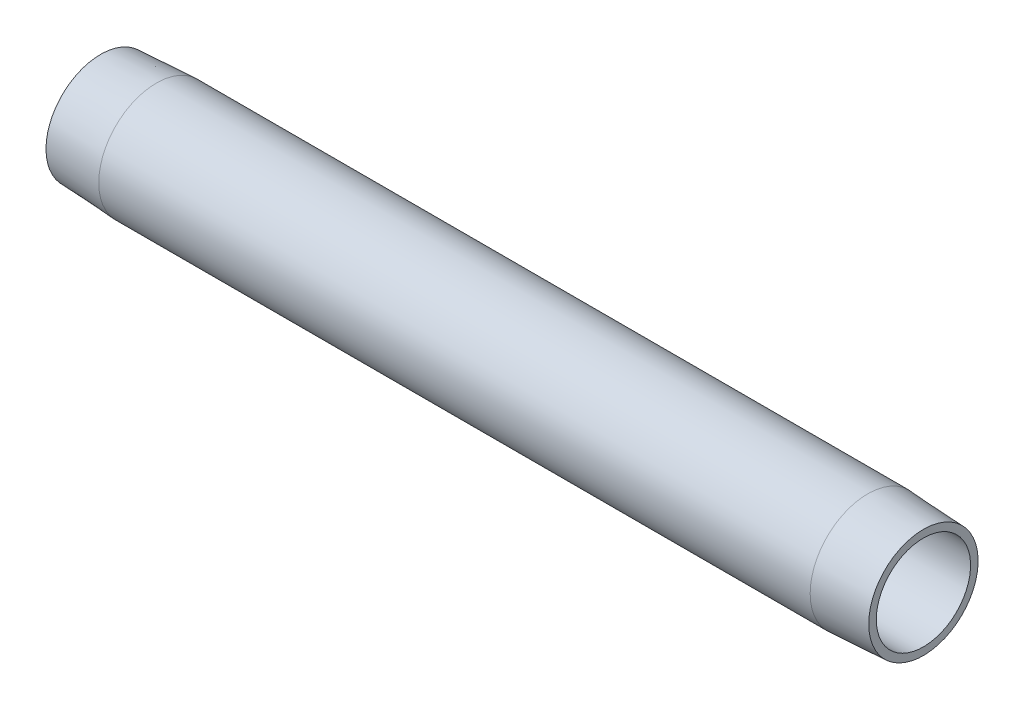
ISO-10303-21;
HEADER;
FILE_DESCRIPTION(('STEP AP214'),'2;1');
FILE_NAME('part.step','',(''),(''),'','','');
FILE_SCHEMA(('AUTOMOTIVE_DESIGN { 1 0 10303 214 1 1 1 1 }'));
ENDSEC;
DATA;
#1=APPLICATION_CONTEXT('core data for automotive mechanical design processes');
#2=APPLICATION_PROTOCOL_DEFINITION('international standard','automotive_design',2000,#1);
#3=PRODUCT_CONTEXT('',#1,'mechanical');
#4=PRODUCT('Part','Part','',(#3));
#5=PRODUCT_RELATED_PRODUCT_CATEGORY('part','',(#4));
#6=PRODUCT_DEFINITION_FORMATION('','',#4);
#7=PRODUCT_DEFINITION_CONTEXT('part definition',#1,'design');
#8=PRODUCT_DEFINITION('design','',#6,#7);
#9=PRODUCT_DEFINITION_SHAPE('','',#8);
#10=(LENGTH_UNIT() NAMED_UNIT(*) SI_UNIT(.MILLI.,.METRE.));
#11=(NAMED_UNIT(*) PLANE_ANGLE_UNIT() SI_UNIT($,.RADIAN.));
#12=(NAMED_UNIT(*) SI_UNIT($,.STERADIAN.) SOLID_ANGLE_UNIT());
#13=UNCERTAINTY_MEASURE_WITH_UNIT(LENGTH_MEASURE(1.E-05),#10,'distance_accuracy_value','');
#14=(GEOMETRIC_REPRESENTATION_CONTEXT(3) GLOBAL_UNCERTAINTY_ASSIGNED_CONTEXT((#13)) GLOBAL_UNIT_ASSIGNED_CONTEXT((#10,
#11,#12)) REPRESENTATION_CONTEXT('',''));
#15=CARTESIAN_POINT('',(0.,0.,0.));
#16=DIRECTION('',(0.,0.,1.));
#17=DIRECTION('',(1.,0.,0.));
#18=AXIS2_PLACEMENT_3D('',#15,#16,#17);
#19=CARTESIAN_POINT('',(152.4,8.73125,0.));
#20=DIRECTION('',(-1.,0.,0.));
#21=DIRECTION('',(0.,0.,1.));
#22=AXIS2_PLACEMENT_3D('',#19,#20,#21);
#23=PLANE('',#22);
#24=CARTESIAN_POINT('',(152.4,0.,0.));
#25=DIRECTION('',(-1.,0.,0.));
#26=DIRECTION('',(0.,0.,1.));
#27=AXIS2_PLACEMENT_3D('',#24,#25,#26);
#28=CIRCLE('',#27,10.1275500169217);
#29=CARTESIAN_POINT('',(152.4,0.,10.1275500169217));
#30=VERTEX_POINT('',#29);
#31=EDGE_CURVE('E10',#30,#30,#28,.T.);
#32=ORIENTED_EDGE('',*,*,#31,.F.);
#33=EDGE_LOOP('',(#32));
#34=FACE_BOUND('',#33,.T.);
#35=CARTESIAN_POINT('',(152.4,0.,0.));
#36=DIRECTION('',(-1.,0.,0.));
#37=DIRECTION('',(0.,0.,1.));
#38=AXIS2_PLACEMENT_3D('',#35,#36,#37);
#39=CIRCLE('',#38,8.73125);
#40=CARTESIAN_POINT('',(152.4,0.,8.73125));
#41=VERTEX_POINT('',#40);
#42=EDGE_CURVE('E52',#41,#41,#39,.T.);
#43=ORIENTED_EDGE('',*,*,#42,.T.);
#44=EDGE_LOOP('',(#43));
#45=FACE_BOUND('',#44,.T.);
#46=ADVANCED_FACE('F30',(#34,#45),#23,.F.);
#47=CARTESIAN_POINT('',(152.4,0.,0.));
#48=DIRECTION('',(-1.,0.,0.));
#49=DIRECTION('',(0.,0.,1.));
#50=AXIS2_PLACEMENT_3D('',#47,#48,#49);
#51=CONICAL_SURFACE('',#50,10.1275500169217,0.0523598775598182);
#52=CARTESIAN_POINT('',(142.0876,0.,0.));
#53=DIRECTION('',(-1.,0.,0.));
#54=DIRECTION('',(0.,0.,1.));
#55=AXIS2_PLACEMENT_3D('',#52,#53,#54);
#56=CIRCLE('',#55,10.668);
#57=CARTESIAN_POINT('',(142.0876,0.,10.668));
#58=VERTEX_POINT('',#57);
#59=EDGE_CURVE('E36',#58,#58,#56,.T.);
#60=ORIENTED_EDGE('',*,*,#59,.F.);
#61=EDGE_LOOP('',(#60));
#62=FACE_BOUND('',#61,.T.);
#63=ORIENTED_EDGE('',*,*,#31,.T.);
#64=EDGE_LOOP('',(#63));
#65=FACE_BOUND('',#64,.T.);
#66=ADVANCED_FACE('F77',(#62,#65),#51,.T.);
#67=CARTESIAN_POINT('',(0.,0.,0.));
#68=DIRECTION('',(-1.,0.,0.));
#69=DIRECTION('',(0.,0.,1.));
#70=AXIS2_PLACEMENT_3D('',#67,#68,#69);
#71=CYLINDRICAL_SURFACE('',#70,10.668);
#72=CARTESIAN_POINT('',(10.3124,0.,0.));
#73=DIRECTION('',(-1.,0.,0.));
#74=DIRECTION('',(0.,0.,1.));
#75=AXIS2_PLACEMENT_3D('',#72,#73,#74);
#76=CIRCLE('',#75,10.668);
#77=CARTESIAN_POINT('',(10.3124,0.,10.668));
#78=VERTEX_POINT('',#77);
#79=EDGE_CURVE('E40',#78,#78,#76,.T.);
#80=ORIENTED_EDGE('',*,*,#79,.F.);
#81=EDGE_LOOP('',(#80));
#82=FACE_BOUND('',#81,.T.);
#83=ORIENTED_EDGE('',*,*,#59,.T.);
#84=EDGE_LOOP('',(#83));
#85=FACE_BOUND('',#84,.T.);
#86=ADVANCED_FACE('F72',(#82,#85),#71,.T.);
#87=CARTESIAN_POINT('',(10.3124,0.,0.));
#88=DIRECTION('',(1.,0.,0.));
#89=DIRECTION('',(0.,0.,-1.));
#90=AXIS2_PLACEMENT_3D('',#87,#88,#89);
#91=CONICAL_SURFACE('',#90,10.668,0.0523598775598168);
#92=CARTESIAN_POINT('',(0.,0.,0.));
#93=DIRECTION('',(-1.,0.,0.));
#94=DIRECTION('',(0.,0.,1.));
#95=AXIS2_PLACEMENT_3D('',#92,#93,#94);
#96=CIRCLE('',#95,10.1275500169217);
#97=CARTESIAN_POINT('',(0.,0.,10.1275500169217));
#98=VERTEX_POINT('',#97);
#99=EDGE_CURVE('E44',#98,#98,#96,.T.);
#100=ORIENTED_EDGE('',*,*,#99,.F.);
#101=EDGE_LOOP('',(#100));
#102=FACE_BOUND('',#101,.T.);
#103=ORIENTED_EDGE('',*,*,#79,.T.);
#104=EDGE_LOOP('',(#103));
#105=FACE_BOUND('',#104,.T.);
#106=ADVANCED_FACE('F66',(#102,#105),#91,.T.);
#107=CARTESIAN_POINT('',(0.,10.1275500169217,0.));
#108=DIRECTION('',(1.,0.,0.));
#109=DIRECTION('',(0.,0.,-1.));
#110=AXIS2_PLACEMENT_3D('',#107,#108,#109);
#111=PLANE('',#110);
#112=CARTESIAN_POINT('',(0.,0.,0.));
#113=DIRECTION('',(-1.,0.,0.));
#114=DIRECTION('',(0.,0.,1.));
#115=AXIS2_PLACEMENT_3D('',#112,#113,#114);
#116=CIRCLE('',#115,8.73125);
#117=CARTESIAN_POINT('',(0.,0.,8.73125));
#118=VERTEX_POINT('',#117);
#119=EDGE_CURVE('E49',#118,#118,#116,.T.);
#120=ORIENTED_EDGE('',*,*,#119,.F.);
#121=EDGE_LOOP('',(#120));
#122=FACE_BOUND('',#121,.T.);
#123=ORIENTED_EDGE('',*,*,#99,.T.);
#124=EDGE_LOOP('',(#123));
#125=FACE_BOUND('',#124,.T.);
#126=ADVANCED_FACE('F60',(#122,#125),#111,.F.);
#127=CARTESIAN_POINT('',(0.,0.,0.));
#128=DIRECTION('',(-1.,0.,0.));
#129=DIRECTION('',(0.,0.,1.));
#130=AXIS2_PLACEMENT_3D('',#127,#128,#129);
#131=CYLINDRICAL_SURFACE('',#130,8.73125);
#132=ORIENTED_EDGE('',*,*,#42,.F.);
#133=EDGE_LOOP('',(#132));
#134=FACE_BOUND('',#133,.T.);
#135=ORIENTED_EDGE('',*,*,#119,.T.);
#136=EDGE_LOOP('',(#135));
#137=FACE_BOUND('',#136,.T.);
#138=ADVANCED_FACE('F57',(#134,#137),#131,.F.);
#139=CLOSED_SHELL('',(#46,#66,#86,#106,#126,#138));
#140=MANIFOLD_SOLID_BREP('B2',#139);
#141=ADVANCED_BREP_SHAPE_REPRESENTATION('',(#18,#140),#14);
#142=SHAPE_DEFINITION_REPRESENTATION(#9,#141);
ENDSEC;
END-ISO-10303-21;
